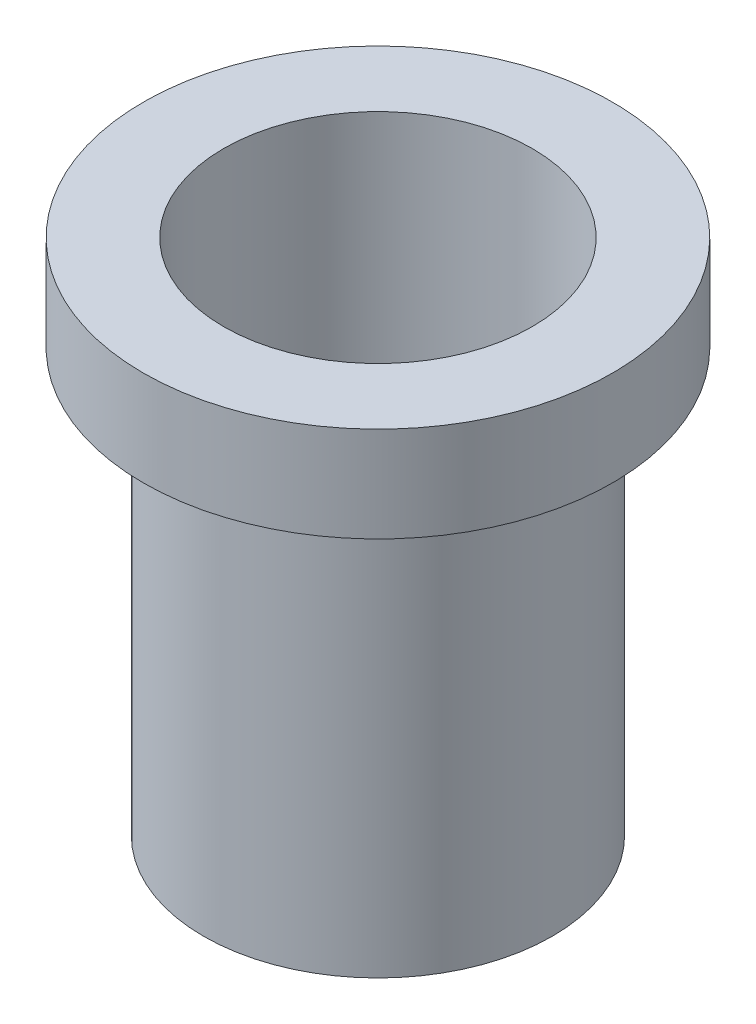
ISO-10303-21;
HEADER;
FILE_DESCRIPTION(('STEP AP214'),'2;1');
FILE_NAME('part.step','',(''),(''),'','','');
FILE_SCHEMA(('AUTOMOTIVE_DESIGN { 1 0 10303 214 1 1 1 1 }'));
ENDSEC;
DATA;
#1=APPLICATION_CONTEXT('core data for automotive mechanical design processes');
#2=APPLICATION_PROTOCOL_DEFINITION('international standard','automotive_design',2000,#1);
#3=PRODUCT_CONTEXT('',#1,'mechanical');
#4=PRODUCT('Part','Part','',(#3));
#5=PRODUCT_RELATED_PRODUCT_CATEGORY('part','',(#4));
#6=PRODUCT_DEFINITION_FORMATION('','',#4);
#7=PRODUCT_DEFINITION_CONTEXT('part definition',#1,'design');
#8=PRODUCT_DEFINITION('design','',#6,#7);
#9=PRODUCT_DEFINITION_SHAPE('','',#8);
#10=(LENGTH_UNIT() NAMED_UNIT(*) SI_UNIT(.MILLI.,.METRE.));
#11=(NAMED_UNIT(*) PLANE_ANGLE_UNIT() SI_UNIT($,.RADIAN.));
#12=(NAMED_UNIT(*) SI_UNIT($,.STERADIAN.) SOLID_ANGLE_UNIT());
#13=UNCERTAINTY_MEASURE_WITH_UNIT(LENGTH_MEASURE(1.E-05),#10,'distance_accuracy_value','');
#14=(GEOMETRIC_REPRESENTATION_CONTEXT(3) GLOBAL_UNCERTAINTY_ASSIGNED_CONTEXT((#13)) GLOBAL_UNIT_ASSIGNED_CONTEXT((#10,
#11,#12)) REPRESENTATION_CONTEXT('',''));
#15=CARTESIAN_POINT('',(0.,0.,0.));
#16=DIRECTION('',(0.,0.,1.));
#17=DIRECTION('',(1.,0.,0.));
#18=AXIS2_PLACEMENT_3D('',#15,#16,#17);
#19=CARTESIAN_POINT('',(0.,11.5156262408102,0.));
#20=DIRECTION('',(0.,1.,0.));
#21=DIRECTION('',(0.,0.,1.));
#22=AXIS2_PLACEMENT_3D('',#19,#20,#21);
#23=CYLINDRICAL_SURFACE('',#22,46.355);
#24=CARTESIAN_POINT('',(0.,-155.575,0.));
#25=DIRECTION('',(0.,1.,0.));
#26=DIRECTION('',(0.,0.,1.));
#27=AXIS2_PLACEMENT_3D('',#24,#25,#26);
#28=CIRCLE('',#27,46.355);
#29=CARTESIAN_POINT('',(0.,-155.575,46.355));
#30=VERTEX_POINT('',#29);
#31=EDGE_CURVE('E10',#30,#30,#28,.T.);
#32=ORIENTED_EDGE('',*,*,#31,.F.);
#33=EDGE_LOOP('',(#32));
#34=FACE_BOUND('',#33,.T.);
#35=CARTESIAN_POINT('',(0.,0.,0.));
#36=DIRECTION('',(0.,1.,0.));
#37=DIRECTION('',(0.,0.,1.));
#38=AXIS2_PLACEMENT_3D('',#35,#36,#37);
#39=CIRCLE('',#38,46.355);
#40=CARTESIAN_POINT('',(0.,0.,46.355));
#41=VERTEX_POINT('',#40);
#42=EDGE_CURVE('E52',#41,#41,#39,.T.);
#43=ORIENTED_EDGE('',*,*,#42,.T.);
#44=EDGE_LOOP('',(#43));
#45=FACE_BOUND('',#44,.T.);
#46=ADVANCED_FACE('F30',(#34,#45),#23,.F.);
#47=CARTESIAN_POINT('',(46.355,-155.575,0.));
#48=DIRECTION('',(0.,1.,0.));
#49=DIRECTION('',(0.,0.,1.));
#50=AXIS2_PLACEMENT_3D('',#47,#48,#49);
#51=PLANE('',#50);
#52=CARTESIAN_POINT('',(0.,-155.575,0.));
#53=DIRECTION('',(0.,1.,0.));
#54=DIRECTION('',(0.,0.,1.));
#55=AXIS2_PLACEMENT_3D('',#52,#53,#54);
#56=CIRCLE('',#55,52.3875);
#57=CARTESIAN_POINT('',(0.,-155.575,52.3875));
#58=VERTEX_POINT('',#57);
#59=EDGE_CURVE('E36',#58,#58,#56,.T.);
#60=ORIENTED_EDGE('',*,*,#59,.F.);
#61=EDGE_LOOP('',(#60));
#62=FACE_BOUND('',#61,.T.);
#63=ORIENTED_EDGE('',*,*,#31,.T.);
#64=EDGE_LOOP('',(#63));
#65=FACE_BOUND('',#64,.T.);
#66=ADVANCED_FACE('F77',(#62,#65),#51,.F.);
#67=CARTESIAN_POINT('',(0.,11.5156262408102,0.));
#68=DIRECTION('',(0.,1.,0.));
#69=DIRECTION('',(0.,0.,1.));
#70=AXIS2_PLACEMENT_3D('',#67,#68,#69);
#71=CYLINDRICAL_SURFACE('',#70,52.3875);
#72=CARTESIAN_POINT('',(0.,-28.575,0.));
#73=DIRECTION('',(0.,1.,0.));
#74=DIRECTION('',(0.,0.,1.));
#75=AXIS2_PLACEMENT_3D('',#72,#73,#74);
#76=CIRCLE('',#75,52.3875);
#77=CARTESIAN_POINT('',(0.,-28.575,52.3875));
#78=VERTEX_POINT('',#77);
#79=EDGE_CURVE('E40',#78,#78,#76,.T.);
#80=ORIENTED_EDGE('',*,*,#79,.F.);
#81=EDGE_LOOP('',(#80));
#82=FACE_BOUND('',#81,.T.);
#83=ORIENTED_EDGE('',*,*,#59,.T.);
#84=EDGE_LOOP('',(#83));
#85=FACE_BOUND('',#84,.T.);
#86=ADVANCED_FACE('F72',(#82,#85),#71,.T.);
#87=CARTESIAN_POINT('',(52.3875,-28.575,0.));
#88=DIRECTION('',(0.,1.,0.));
#89=DIRECTION('',(0.,0.,1.));
#90=AXIS2_PLACEMENT_3D('',#87,#88,#89);
#91=PLANE('',#90);
#92=CARTESIAN_POINT('',(0.,-28.575,0.));
#93=DIRECTION('',(0.,1.,0.));
#94=DIRECTION('',(0.,0.,1.));
#95=AXIS2_PLACEMENT_3D('',#92,#93,#94);
#96=CIRCLE('',#95,70.485);
#97=CARTESIAN_POINT('',(0.,-28.575,70.485));
#98=VERTEX_POINT('',#97);
#99=EDGE_CURVE('E44',#98,#98,#96,.T.);
#100=ORIENTED_EDGE('',*,*,#99,.F.);
#101=EDGE_LOOP('',(#100));
#102=FACE_BOUND('',#101,.T.);
#103=ORIENTED_EDGE('',*,*,#79,.T.);
#104=EDGE_LOOP('',(#103));
#105=FACE_BOUND('',#104,.T.);
#106=ADVANCED_FACE('F66',(#102,#105),#91,.F.);
#107=CARTESIAN_POINT('',(0.,11.5156262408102,0.));
#108=DIRECTION('',(0.,1.,0.));
#109=DIRECTION('',(0.,0.,1.));
#110=AXIS2_PLACEMENT_3D('',#107,#108,#109);
#111=CYLINDRICAL_SURFACE('',#110,70.485);
#112=CARTESIAN_POINT('',(0.,0.,0.));
#113=DIRECTION('',(0.,1.,0.));
#114=DIRECTION('',(0.,0.,1.));
#115=AXIS2_PLACEMENT_3D('',#112,#113,#114);
#116=CIRCLE('',#115,70.485);
#117=CARTESIAN_POINT('',(0.,0.,70.485));
#118=VERTEX_POINT('',#117);
#119=EDGE_CURVE('E49',#118,#118,#116,.T.);
#120=ORIENTED_EDGE('',*,*,#119,.F.);
#121=EDGE_LOOP('',(#120));
#122=FACE_BOUND('',#121,.T.);
#123=ORIENTED_EDGE('',*,*,#99,.T.);
#124=EDGE_LOOP('',(#123));
#125=FACE_BOUND('',#124,.T.);
#126=ADVANCED_FACE('F60',(#122,#125),#111,.T.);
#127=CARTESIAN_POINT('',(46.355,0.,0.));
#128=DIRECTION('',(0.,-1.,0.));
#129=DIRECTION('',(0.,0.,-1.));
#130=AXIS2_PLACEMENT_3D('',#127,#128,#129);
#131=PLANE('',#130);
#132=ORIENTED_EDGE('',*,*,#42,.F.);
#133=EDGE_LOOP('',(#132));
#134=FACE_BOUND('',#133,.T.);
#135=ORIENTED_EDGE('',*,*,#119,.T.);
#136=EDGE_LOOP('',(#135));
#137=FACE_BOUND('',#136,.T.);
#138=ADVANCED_FACE('F57',(#134,#137),#131,.F.);
#139=CLOSED_SHELL('',(#46,#66,#86,#106,#126,#138));
#140=MANIFOLD_SOLID_BREP('B2',#139);
#141=ADVANCED_BREP_SHAPE_REPRESENTATION('',(#18,#140),#14);
#142=SHAPE_DEFINITION_REPRESENTATION(#9,#141);
ENDSEC;
END-ISO-10303-21;
